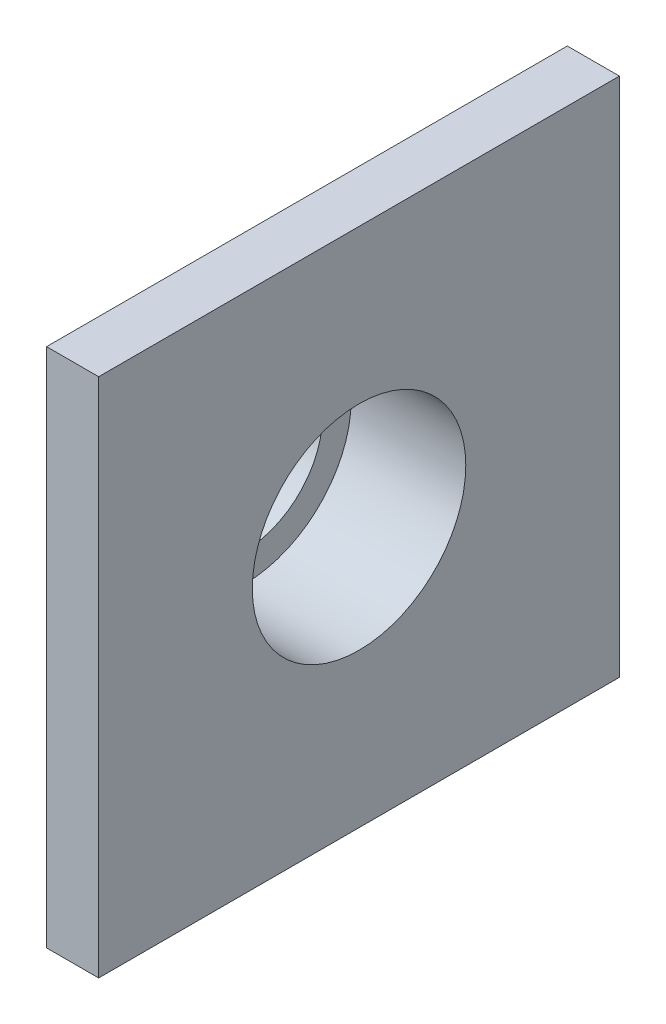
ISO-10303-21;
HEADER;
FILE_DESCRIPTION(('STEP AP214'),'2;1');
FILE_NAME('part.step','',(''),(''),'','','');
FILE_SCHEMA(('AUTOMOTIVE_DESIGN { 1 0 10303 214 1 1 1 1 }'));
ENDSEC;
DATA;
#1=APPLICATION_CONTEXT('core data for automotive mechanical design processes');
#2=APPLICATION_PROTOCOL_DEFINITION('international standard','automotive_design',2000,#1);
#3=PRODUCT_CONTEXT('',#1,'mechanical');
#4=PRODUCT('Part','Part','',(#3));
#5=PRODUCT_RELATED_PRODUCT_CATEGORY('part','',(#4));
#6=PRODUCT_DEFINITION_FORMATION('','',#4);
#7=PRODUCT_DEFINITION_CONTEXT('part definition',#1,'design');
#8=PRODUCT_DEFINITION('design','',#6,#7);
#9=PRODUCT_DEFINITION_SHAPE('','',#8);
#10=(LENGTH_UNIT() NAMED_UNIT(*) SI_UNIT(.MILLI.,.METRE.));
#11=(NAMED_UNIT(*) PLANE_ANGLE_UNIT() SI_UNIT($,.RADIAN.));
#12=(NAMED_UNIT(*) SI_UNIT($,.STERADIAN.) SOLID_ANGLE_UNIT());
#13=UNCERTAINTY_MEASURE_WITH_UNIT(LENGTH_MEASURE(1.E-05),#10,'distance_accuracy_value','');
#14=(GEOMETRIC_REPRESENTATION_CONTEXT(3) GLOBAL_UNCERTAINTY_ASSIGNED_CONTEXT((#13)) GLOBAL_UNIT_ASSIGNED_CONTEXT((#10,
#11,#12)) REPRESENTATION_CONTEXT('',''));
#15=CARTESIAN_POINT('',(0.,0.,0.));
#16=DIRECTION('',(0.,0.,1.));
#17=DIRECTION('',(1.,0.,0.));
#18=AXIS2_PLACEMENT_3D('',#15,#16,#17);
#19=CARTESIAN_POINT('',(1.,0.,0.));
#20=DIRECTION('',(1.,0.,0.));
#21=DIRECTION('',(0.,0.,-1.));
#22=AXIS2_PLACEMENT_3D('',#19,#20,#21);
#23=PLANE('',#22);
#24=CARTESIAN_POINT('',(1.,0.,0.));
#25=DIRECTION('',(1.,0.,0.));
#26=DIRECTION('',(0.,0.,-1.));
#27=AXIS2_PLACEMENT_3D('',#24,#25,#26);
#28=CIRCLE('',#27,1.5);
#29=CARTESIAN_POINT('',(1.,0.,-1.5));
#30=VERTEX_POINT('',#29);
#31=EDGE_CURVE('E55',#30,#30,#28,.T.);
#32=ORIENTED_EDGE('',*,*,#31,.F.);
#33=EDGE_LOOP('',(#32));
#34=FACE_BOUND('',#33,.T.);
#35=CARTESIAN_POINT('',(1.,0.,0.));
#36=DIRECTION('',(1.,0.,0.));
#37=DIRECTION('',(0.,0.,-1.));
#38=AXIS2_PLACEMENT_3D('',#35,#36,#37);
#39=CIRCLE('',#38,2.05);
#40=CARTESIAN_POINT('',(1.,0.,-2.05));
#41=VERTEX_POINT('',#40);
#42=EDGE_CURVE('E136',#41,#41,#39,.T.);
#43=ORIENTED_EDGE('',*,*,#42,.T.);
#44=EDGE_LOOP('',(#43));
#45=FACE_BOUND('',#44,.T.);
#46=ADVANCED_FACE('F45',(#34,#45),#23,.T.);
#47=CARTESIAN_POINT('',(0.,0.,0.));
#48=DIRECTION('',(1.,0.,0.));
#49=DIRECTION('',(0.,0.,-1.));
#50=AXIS2_PLACEMENT_3D('',#47,#48,#49);
#51=PLANE('',#50);
#52=CARTESIAN_POINT('',(0.,0.,0.));
#53=DIRECTION('',(1.,0.,0.));
#54=DIRECTION('',(0.,0.,-1.));
#55=AXIS2_PLACEMENT_3D('',#52,#53,#54);
#56=CIRCLE('',#55,2.5);
#57=CARTESIAN_POINT('',(0.,0.,-2.5));
#58=VERTEX_POINT('',#57);
#59=EDGE_CURVE('E11',#58,#58,#56,.T.);
#60=ORIENTED_EDGE('',*,*,#59,.F.);
#61=EDGE_LOOP('',(#60));
#62=FACE_BOUND('',#61,.T.);
#63=CARTESIAN_POINT('',(0.,0.,0.));
#64=DIRECTION('',(1.,0.,0.));
#65=DIRECTION('',(0.,0.,-1.));
#66=AXIS2_PLACEMENT_3D('',#63,#64,#65);
#67=CIRCLE('',#66,1.5);
#68=CARTESIAN_POINT('',(0.,0.,-1.5));
#69=VERTEX_POINT('',#68);
#70=EDGE_CURVE('E144',#69,#69,#67,.T.);
#71=ORIENTED_EDGE('',*,*,#70,.T.);
#72=EDGE_LOOP('',(#71));
#73=FACE_BOUND('',#72,.T.);
#74=ADVANCED_FACE('F151',(#62,#73),#51,.F.);
#75=CARTESIAN_POINT('',(1.,0.,0.));
#76=DIRECTION('',(-1.,0.,0.));
#77=DIRECTION('',(0.,0.,1.));
#78=AXIS2_PLACEMENT_3D('',#75,#76,#77);
#79=CYLINDRICAL_SURFACE('',#78,2.5);
#80=ORIENTED_EDGE('',*,*,#59,.T.);
#81=EDGE_LOOP('',(#80));
#82=FACE_BOUND('',#81,.T.);
#83=CARTESIAN_POINT('',(2.2,0.,0.));
#84=DIRECTION('',(1.,0.,0.));
#85=DIRECTION('',(0.,0.,-1.));
#86=AXIS2_PLACEMENT_3D('',#83,#84,#85);
#87=CIRCLE('',#86,2.5);
#88=CARTESIAN_POINT('',(2.2,0.,-2.5));
#89=VERTEX_POINT('',#88);
#90=EDGE_CURVE('E140',#89,#89,#87,.T.);
#91=ORIENTED_EDGE('',*,*,#90,.F.);
#92=EDGE_LOOP('',(#91));
#93=FACE_BOUND('',#92,.T.);
#94=ADVANCED_FACE('F47',(#82,#93),#79,.T.);
#95=CARTESIAN_POINT('',(1.,0.,0.));
#96=DIRECTION('',(-1.,0.,0.));
#97=DIRECTION('',(0.,0.,1.));
#98=AXIS2_PLACEMENT_3D('',#95,#96,#97);
#99=CYLINDRICAL_SURFACE('',#98,1.5);
#100=ORIENTED_EDGE('',*,*,#31,.T.);
#101=EDGE_LOOP('',(#100));
#102=FACE_BOUND('',#101,.T.);
#103=ORIENTED_EDGE('',*,*,#70,.F.);
#104=EDGE_LOOP('',(#103));
#105=FACE_BOUND('',#104,.T.);
#106=ADVANCED_FACE('F153',(#102,#105),#99,.F.);
#107=CARTESIAN_POINT('',(2.2,0.,0.));
#108=DIRECTION('',(-1.,0.,0.));
#109=DIRECTION('',(0.,0.,1.));
#110=AXIS2_PLACEMENT_3D('',#107,#108,#109);
#111=CYLINDRICAL_SURFACE('',#110,2.05);
#112=ORIENTED_EDGE('',*,*,#42,.F.);
#113=EDGE_LOOP('',(#112));
#114=FACE_BOUND('',#113,.T.);
#115=CARTESIAN_POINT('',(3.2,0.,0.));
#116=DIRECTION('',(1.,0.,0.));
#117=DIRECTION('',(0.,0.,-1.));
#118=AXIS2_PLACEMENT_3D('',#115,#116,#117);
#119=CIRCLE('',#118,2.05);
#120=CARTESIAN_POINT('',(3.2,0.,-2.05));
#121=VERTEX_POINT('',#120);
#122=EDGE_CURVE('E123',#121,#121,#119,.T.);
#123=ORIENTED_EDGE('',*,*,#122,.T.);
#124=EDGE_LOOP('',(#123));
#125=FACE_BOUND('',#124,.T.);
#126=ADVANCED_FACE('F155',(#114,#125),#111,.F.);
#127=CARTESIAN_POINT('',(3.2,0.,0.));
#128=DIRECTION('',(1.,0.,0.));
#129=DIRECTION('',(0.,0.,-1.));
#130=AXIS2_PLACEMENT_3D('',#127,#128,#129);
#131=PLANE('',#130);
#132=DIRECTION('',(0.,-1.,0.));
#133=VECTOR('',#132,1.);
#134=CARTESIAN_POINT('',(3.2,-5.,5.));
#135=LINE('',#134,#133);
#136=CARTESIAN_POINT('',(3.2,5.,5.));
#137=VERTEX_POINT('',#136);
#138=CARTESIAN_POINT('',(3.2,-5.,5.));
#139=VERTEX_POINT('',#138);
#140=EDGE_CURVE('E100',#137,#139,#135,.T.);
#141=ORIENTED_EDGE('',*,*,#140,.T.);
#142=DIRECTION('',(0.,0.,-1.));
#143=VECTOR('',#142,1.);
#144=CARTESIAN_POINT('',(3.2,-5.,-5.));
#145=LINE('',#144,#143);
#146=CARTESIAN_POINT('',(3.2,-5.,-5.));
#147=VERTEX_POINT('',#146);
#148=EDGE_CURVE('E94',#139,#147,#145,.T.);
#149=ORIENTED_EDGE('',*,*,#148,.T.);
#150=DIRECTION('',(0.,1.,0.));
#151=VECTOR('',#150,1.);
#152=CARTESIAN_POINT('',(3.2,-5.,-5.));
#153=LINE('',#152,#151);
#154=CARTESIAN_POINT('',(3.2,5.,-5.));
#155=VERTEX_POINT('',#154);
#156=EDGE_CURVE('E98',#147,#155,#153,.T.);
#157=ORIENTED_EDGE('',*,*,#156,.T.);
#158=DIRECTION('',(0.,0.,1.));
#159=VECTOR('',#158,1.);
#160=CARTESIAN_POINT('',(3.2,5.,-5.));
#161=LINE('',#160,#159);
#162=EDGE_CURVE('E63',#155,#137,#161,.T.);
#163=ORIENTED_EDGE('',*,*,#162,.T.);
#164=EDGE_LOOP('',(#141,#149,#157,#163));
#165=FACE_BOUND('',#164,.T.);
#166=ORIENTED_EDGE('',*,*,#122,.F.);
#167=EDGE_LOOP('',(#166));
#168=FACE_BOUND('',#167,.T.);
#169=ADVANCED_FACE('F95',(#165,#168),#131,.T.);
#170=CARTESIAN_POINT('',(2.2,0.,0.));
#171=DIRECTION('',(1.,0.,0.));
#172=DIRECTION('',(0.,0.,-1.));
#173=AXIS2_PLACEMENT_3D('',#170,#171,#172);
#174=PLANE('',#173);
#175=ORIENTED_EDGE('',*,*,#90,.T.);
#176=EDGE_LOOP('',(#175));
#177=FACE_BOUND('',#176,.T.);
#178=DIRECTION('',(0.,-1.,0.));
#179=VECTOR('',#178,1.);
#180=CARTESIAN_POINT('',(2.2,-5.,5.));
#181=LINE('',#180,#179);
#182=CARTESIAN_POINT('',(2.2,5.,5.));
#183=VERTEX_POINT('',#182);
#184=CARTESIAN_POINT('',(2.2,-5.,5.));
#185=VERTEX_POINT('',#184);
#186=EDGE_CURVE('E119',#183,#185,#181,.T.);
#187=ORIENTED_EDGE('',*,*,#186,.F.);
#188=DIRECTION('',(0.,0.,1.));
#189=VECTOR('',#188,1.);
#190=CARTESIAN_POINT('',(2.2,5.,-5.));
#191=LINE('',#190,#189);
#192=CARTESIAN_POINT('',(2.2,5.,-5.));
#193=VERTEX_POINT('',#192);
#194=EDGE_CURVE('E86',#193,#183,#191,.T.);
#195=ORIENTED_EDGE('',*,*,#194,.F.);
#196=DIRECTION('',(0.,1.,0.));
#197=VECTOR('',#196,1.);
#198=CARTESIAN_POINT('',(2.2,-5.,-5.));
#199=LINE('',#198,#197);
#200=CARTESIAN_POINT('',(2.2,-5.,-5.));
#201=VERTEX_POINT('',#200);
#202=EDGE_CURVE('E80',#201,#193,#199,.T.);
#203=ORIENTED_EDGE('',*,*,#202,.F.);
#204=DIRECTION('',(0.,0.,-1.));
#205=VECTOR('',#204,1.);
#206=CARTESIAN_POINT('',(2.2,-5.,-5.));
#207=LINE('',#206,#205);
#208=EDGE_CURVE('E106',#185,#201,#207,.T.);
#209=ORIENTED_EDGE('',*,*,#208,.F.);
#210=EDGE_LOOP('',(#187,#195,#203,#209));
#211=FACE_BOUND('',#210,.T.);
#212=ADVANCED_FACE('F182',(#177,#211),#174,.F.);
#213=CARTESIAN_POINT('',(3.2,-5.,5.));
#214=DIRECTION('',(0.,0.,-1.));
#215=DIRECTION('',(-1.,0.,0.));
#216=AXIS2_PLACEMENT_3D('',#213,#214,#215);
#217=PLANE('',#216);
#218=ORIENTED_EDGE('',*,*,#186,.T.);
#219=DIRECTION('',(-1.,0.,0.));
#220=VECTOR('',#219,1.);
#221=CARTESIAN_POINT('',(3.2,-5.,5.));
#222=LINE('',#221,#220);
#223=EDGE_CURVE('E108',#139,#185,#222,.T.);
#224=ORIENTED_EDGE('',*,*,#223,.F.);
#225=ORIENTED_EDGE('',*,*,#140,.F.);
#226=DIRECTION('',(-1.,0.,0.));
#227=VECTOR('',#226,1.);
#228=CARTESIAN_POINT('',(3.2,5.,5.));
#229=LINE('',#228,#227);
#230=EDGE_CURVE('E115',#137,#183,#229,.T.);
#231=ORIENTED_EDGE('',*,*,#230,.T.);
#232=EDGE_LOOP('',(#218,#224,#225,#231));
#233=FACE_BOUND('',#232,.T.);
#234=ADVANCED_FACE('F187',(#233),#217,.F.);
#235=CARTESIAN_POINT('',(3.2,-5.,-5.));
#236=DIRECTION('',(0.,1.,0.));
#237=DIRECTION('',(0.,0.,1.));
#238=AXIS2_PLACEMENT_3D('',#235,#236,#237);
#239=PLANE('',#238);
#240=ORIENTED_EDGE('',*,*,#208,.T.);
#241=DIRECTION('',(-1.,0.,0.));
#242=VECTOR('',#241,1.);
#243=CARTESIAN_POINT('',(3.2,-5.,-5.));
#244=LINE('',#243,#242);
#245=EDGE_CURVE('E104',#147,#201,#244,.T.);
#246=ORIENTED_EDGE('',*,*,#245,.F.);
#247=ORIENTED_EDGE('',*,*,#148,.F.);
#248=ORIENTED_EDGE('',*,*,#223,.T.);
#249=EDGE_LOOP('',(#240,#246,#247,#248));
#250=FACE_BOUND('',#249,.T.);
#251=ADVANCED_FACE('F105',(#250),#239,.F.);
#252=CARTESIAN_POINT('',(3.2,-5.,-5.));
#253=DIRECTION('',(0.,0.,1.));
#254=DIRECTION('',(1.,0.,0.));
#255=AXIS2_PLACEMENT_3D('',#252,#253,#254);
#256=PLANE('',#255);
#257=ORIENTED_EDGE('',*,*,#202,.T.);
#258=DIRECTION('',(-1.,0.,0.));
#259=VECTOR('',#258,1.);
#260=CARTESIAN_POINT('',(3.2,5.,-5.));
#261=LINE('',#260,#259);
#262=EDGE_CURVE('E109',#155,#193,#261,.T.);
#263=ORIENTED_EDGE('',*,*,#262,.F.);
#264=ORIENTED_EDGE('',*,*,#156,.F.);
#265=ORIENTED_EDGE('',*,*,#245,.T.);
#266=EDGE_LOOP('',(#257,#263,#264,#265));
#267=FACE_BOUND('',#266,.T.);
#268=ADVANCED_FACE('F111',(#267),#256,.F.);
#269=CARTESIAN_POINT('',(3.2,5.,-5.));
#270=DIRECTION('',(0.,-1.,0.));
#271=DIRECTION('',(0.,0.,-1.));
#272=AXIS2_PLACEMENT_3D('',#269,#270,#271);
#273=PLANE('',#272);
#274=ORIENTED_EDGE('',*,*,#194,.T.);
#275=ORIENTED_EDGE('',*,*,#230,.F.);
#276=ORIENTED_EDGE('',*,*,#162,.F.);
#277=ORIENTED_EDGE('',*,*,#262,.T.);
#278=EDGE_LOOP('',(#274,#275,#276,#277));
#279=FACE_BOUND('',#278,.T.);
#280=ADVANCED_FACE('F191',(#279),#273,.F.);
#281=CLOSED_SHELL('',(#46,#74,#94,#106,#126,#169,#212,#234,#251,#268,#280));
#282=MANIFOLD_SOLID_BREP('B2',#281);
#283=ADVANCED_BREP_SHAPE_REPRESENTATION('',(#18,#282),#14);
#284=SHAPE_DEFINITION_REPRESENTATION(#9,#283);
ENDSEC;
END-ISO-10303-21;
